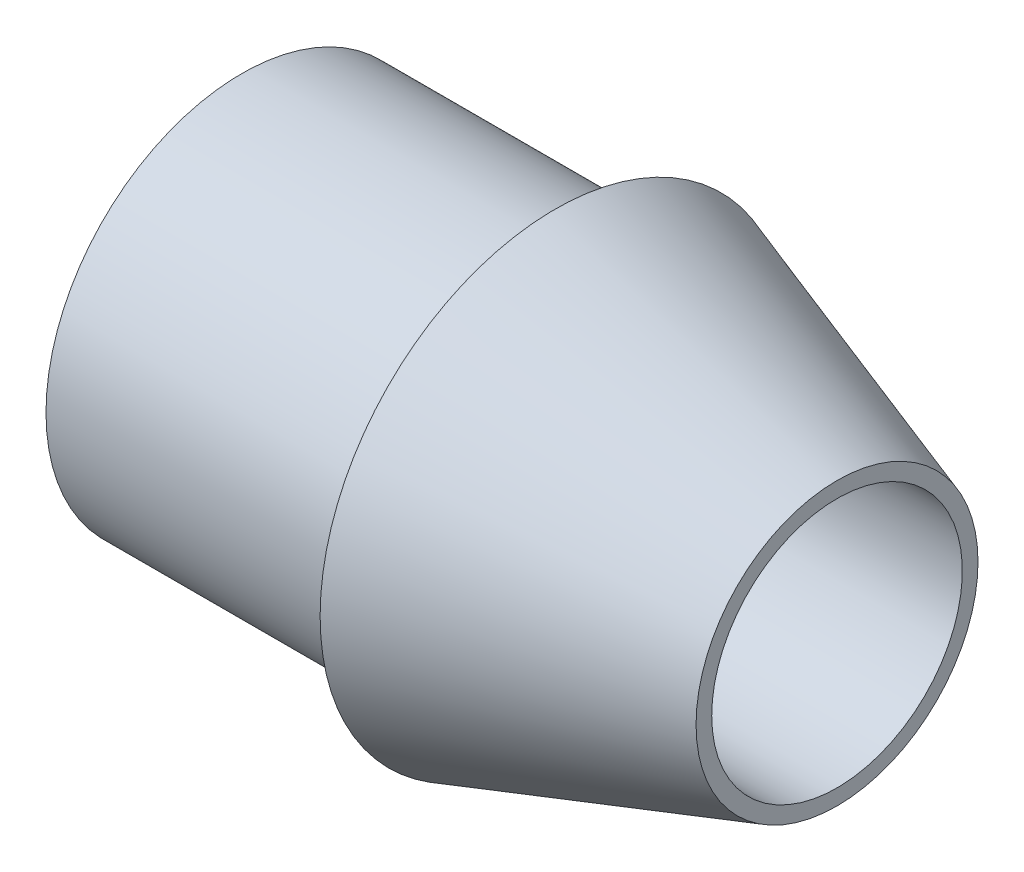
from build123d import *

# Parameters (mm, degrees)
ESQUISSE2_R             = 6
ENL_V_MAT_EXTRU_1_DEPTH = 18.168284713
ESQUISSE3_R             = 6.25
BOSS_EXTRU_1_DEPTH      = 10
ESQUISSE4_R             = 4
ENL_V_MAT_EXTRU_2_DEPTH = 22.760055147


with BuildPart() as part:
    # Esquisse1 → Base-R_volution (revolve)
    with BuildSketch(Plane.XY, mode=Mode.PRIVATE) as base_r_volution_sk:
        Polygon((0, 0), (-22.5, 0), (-22.5, 7.5), align=None)
    revolve(base_r_volution_sk.sketch.rotate(Axis((-31, 0, 0), (1, 0, 0)), 90), axis=Axis((-31, 0, 0), (1, 0, 0)))

    # Esquisse2 → Enl_v. mat.-Extru.1 (cut, through all)
    with BuildSketch(Plane(origin=(-13.5, 0, 0), x_dir=(0, 0, -1), z_dir=(1, 0, 0))):
        Circle(ESQUISSE2_R)
    extrude(amount=ENL_V_MAT_EXTRU_1_DEPTH, mode=Mode.SUBTRACT)

    # Esquisse3 → Boss.-Extru.1 (add)
    with BuildSketch(Plane.ZY.offset(22.5)):
        with Locations(Location((0, 0, 0), (0, 0, 180))):
            Circle(ESQUISSE3_R)
    extrude(amount=BOSS_EXTRU_1_DEPTH)

    # Esquisse4 → Enl_v. mat.-Extru.2 (cut, through all)
    with BuildSketch(Plane.ZY.offset(32.5)):
        Circle(ESQUISSE4_R)
    extrude(amount=-ENL_V_MAT_EXTRU_2_DEPTH, mode=Mode.SUBTRACT)


solid = part.part
